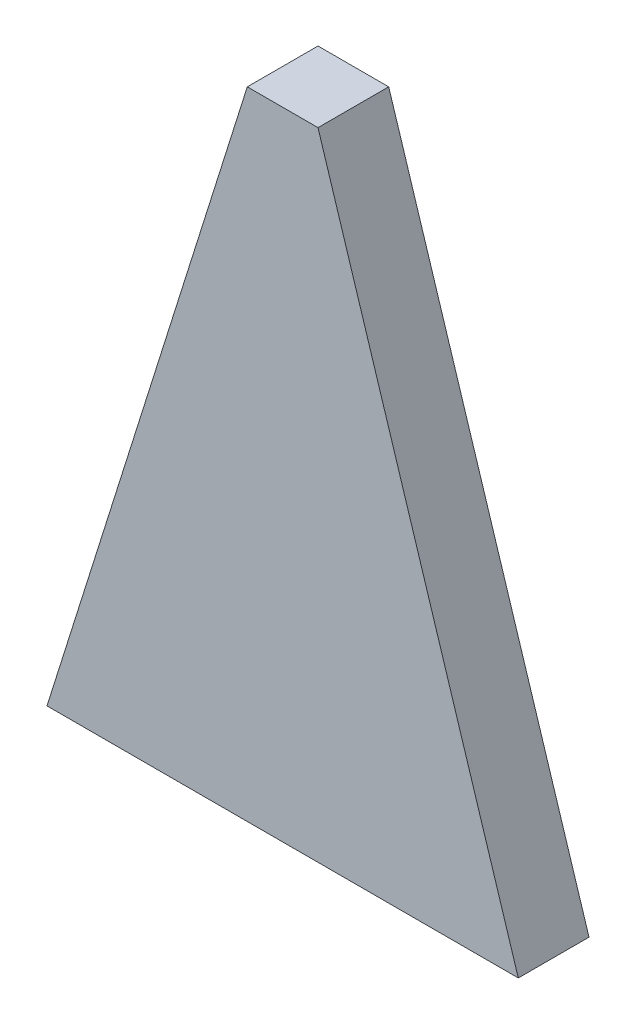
ISO-10303-21;
HEADER;
FILE_DESCRIPTION(('STEP AP214'),'2;1');
FILE_NAME('part.step','',(''),(''),'','','');
FILE_SCHEMA(('AUTOMOTIVE_DESIGN { 1 0 10303 214 1 1 1 1 }'));
ENDSEC;
DATA;
#1=APPLICATION_CONTEXT('core data for automotive mechanical design processes');
#2=APPLICATION_PROTOCOL_DEFINITION('international standard','automotive_design',2000,#1);
#3=PRODUCT_CONTEXT('',#1,'mechanical');
#4=PRODUCT('Part','Part','',(#3));
#5=PRODUCT_RELATED_PRODUCT_CATEGORY('part','',(#4));
#6=PRODUCT_DEFINITION_FORMATION('','',#4);
#7=PRODUCT_DEFINITION_CONTEXT('part definition',#1,'design');
#8=PRODUCT_DEFINITION('design','',#6,#7);
#9=PRODUCT_DEFINITION_SHAPE('','',#8);
#10=(LENGTH_UNIT() NAMED_UNIT(*) SI_UNIT(.MILLI.,.METRE.));
#11=(NAMED_UNIT(*) PLANE_ANGLE_UNIT() SI_UNIT($,.RADIAN.));
#12=(NAMED_UNIT(*) SI_UNIT($,.STERADIAN.) SOLID_ANGLE_UNIT());
#13=UNCERTAINTY_MEASURE_WITH_UNIT(LENGTH_MEASURE(1.E-05),#10,'distance_accuracy_value','');
#14=(GEOMETRIC_REPRESENTATION_CONTEXT(3) GLOBAL_UNCERTAINTY_ASSIGNED_CONTEXT((#13)) GLOBAL_UNIT_ASSIGNED_CONTEXT((#10,
#11,#12)) REPRESENTATION_CONTEXT('',''));
#15=CARTESIAN_POINT('',(0.,0.,0.));
#16=DIRECTION('',(0.,0.,1.));
#17=DIRECTION('',(1.,0.,0.));
#18=AXIS2_PLACEMENT_3D('',#15,#16,#17);
#19=CARTESIAN_POINT('',(-1.5,27.,3.));
#20=DIRECTION('',(0.953849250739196,-0.30028587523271,0.));
#21=DIRECTION('',(0.30028587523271,0.953849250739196,0.));
#22=AXIS2_PLACEMENT_3D('',#19,#20,#21);
#23=PLANE('',#22);
#24=DIRECTION('',(-0.30028587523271,-0.953849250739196,0.));
#25=VECTOR('',#24,1.);
#26=CARTESIAN_POINT('',(-1.5,27.,0.));
#27=LINE('',#26,#25);
#28=CARTESIAN_POINT('',(-1.5,27.,0.));
#29=VERTEX_POINT('',#28);
#30=CARTESIAN_POINT('',(-10.,0.,0.));
#31=VERTEX_POINT('',#30);
#32=EDGE_CURVE('E96',#29,#31,#27,.T.);
#33=ORIENTED_EDGE('',*,*,#32,.T.);
#34=DIRECTION('',(0.,0.,-1.));
#35=VECTOR('',#34,1.);
#36=CARTESIAN_POINT('',(-10.,0.,3.));
#37=LINE('',#36,#35);
#38=CARTESIAN_POINT('',(-10.,0.,3.));
#39=VERTEX_POINT('',#38);
#40=EDGE_CURVE('E11',#39,#31,#37,.T.);
#41=ORIENTED_EDGE('',*,*,#40,.F.);
#42=DIRECTION('',(-0.30028587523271,-0.953849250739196,0.));
#43=VECTOR('',#42,1.);
#44=CARTESIAN_POINT('',(-1.5,27.,3.));
#45=LINE('',#44,#43);
#46=CARTESIAN_POINT('',(-1.5,27.,3.));
#47=VERTEX_POINT('',#46);
#48=EDGE_CURVE('E84',#47,#39,#45,.T.);
#49=ORIENTED_EDGE('',*,*,#48,.F.);
#50=DIRECTION('',(0.,0.,-1.));
#51=VECTOR('',#50,1.);
#52=CARTESIAN_POINT('',(-1.5,27.,3.));
#53=LINE('',#52,#51);
#54=EDGE_CURVE('E92',#47,#29,#53,.T.);
#55=ORIENTED_EDGE('',*,*,#54,.T.);
#56=EDGE_LOOP('',(#33,#41,#49,#55));
#57=FACE_BOUND('',#56,.T.);
#58=ADVANCED_FACE('F33',(#57),#23,.F.);
#59=CARTESIAN_POINT('',(10.,0.,3.));
#60=DIRECTION('',(0.,1.,0.));
#61=DIRECTION('',(-1.,0.,0.));
#62=AXIS2_PLACEMENT_3D('',#59,#60,#61);
#63=PLANE('',#62);
#64=DIRECTION('',(1.,0.,0.));
#65=VECTOR('',#64,1.);
#66=CARTESIAN_POINT('',(10.,0.,0.));
#67=LINE('',#66,#65);
#68=CARTESIAN_POINT('',(10.,0.,0.));
#69=VERTEX_POINT('',#68);
#70=EDGE_CURVE('E88',#31,#69,#67,.T.);
#71=ORIENTED_EDGE('',*,*,#70,.T.);
#72=DIRECTION('',(0.,0.,-1.));
#73=VECTOR('',#72,1.);
#74=CARTESIAN_POINT('',(10.,0.,3.));
#75=LINE('',#74,#73);
#76=CARTESIAN_POINT('',(10.,0.,3.));
#77=VERTEX_POINT('',#76);
#78=EDGE_CURVE('E41',#77,#69,#75,.T.);
#79=ORIENTED_EDGE('',*,*,#78,.F.);
#80=DIRECTION('',(1.,0.,0.));
#81=VECTOR('',#80,1.);
#82=CARTESIAN_POINT('',(-10.,0.,3.));
#83=LINE('',#82,#81);
#84=EDGE_CURVE('E79',#39,#77,#83,.T.);
#85=ORIENTED_EDGE('',*,*,#84,.F.);
#86=ORIENTED_EDGE('',*,*,#40,.T.);
#87=EDGE_LOOP('',(#71,#79,#85,#86));
#88=FACE_BOUND('',#87,.T.);
#89=ADVANCED_FACE('F87',(#88),#63,.F.);
#90=CARTESIAN_POINT('',(1.5,27.,3.));
#91=DIRECTION('',(-0.953849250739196,-0.30028587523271,0.));
#92=DIRECTION('',(0.30028587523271,-0.953849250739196,0.));
#93=AXIS2_PLACEMENT_3D('',#90,#91,#92);
#94=PLANE('',#93);
#95=DIRECTION('',(-0.30028587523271,0.953849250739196,0.));
#96=VECTOR('',#95,1.);
#97=CARTESIAN_POINT('',(1.5,27.,0.));
#98=LINE('',#97,#96);
#99=CARTESIAN_POINT('',(1.5,27.,0.));
#100=VERTEX_POINT('',#99);
#101=EDGE_CURVE('E66',#69,#100,#98,.T.);
#102=ORIENTED_EDGE('',*,*,#101,.T.);
#103=DIRECTION('',(0.,0.,-1.));
#104=VECTOR('',#103,1.);
#105=CARTESIAN_POINT('',(1.5,27.,3.));
#106=LINE('',#105,#104);
#107=CARTESIAN_POINT('',(1.5,27.,3.));
#108=VERTEX_POINT('',#107);
#109=EDGE_CURVE('E89',#108,#100,#106,.T.);
#110=ORIENTED_EDGE('',*,*,#109,.F.);
#111=DIRECTION('',(-0.30028587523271,0.953849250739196,0.));
#112=VECTOR('',#111,1.);
#113=CARTESIAN_POINT('',(1.5,27.,3.));
#114=LINE('',#113,#112);
#115=EDGE_CURVE('E82',#77,#108,#114,.T.);
#116=ORIENTED_EDGE('',*,*,#115,.F.);
#117=ORIENTED_EDGE('',*,*,#78,.T.);
#118=EDGE_LOOP('',(#102,#110,#116,#117));
#119=FACE_BOUND('',#118,.T.);
#120=ADVANCED_FACE('F90',(#119),#94,.F.);
#121=CARTESIAN_POINT('',(1.5,27.,3.));
#122=DIRECTION('',(0.,-1.,0.));
#123=DIRECTION('',(0.,0.,-1.));
#124=AXIS2_PLACEMENT_3D('',#121,#122,#123);
#125=PLANE('',#124);
#126=DIRECTION('',(-1.,0.,0.));
#127=VECTOR('',#126,1.);
#128=CARTESIAN_POINT('',(1.5,27.,0.));
#129=LINE('',#128,#127);
#130=EDGE_CURVE('E72',#100,#29,#129,.T.);
#131=ORIENTED_EDGE('',*,*,#130,.T.);
#132=ORIENTED_EDGE('',*,*,#54,.F.);
#133=DIRECTION('',(-1.,0.,0.));
#134=VECTOR('',#133,1.);
#135=CARTESIAN_POINT('',(1.5,27.,3.));
#136=LINE('',#135,#134);
#137=EDGE_CURVE('E49',#108,#47,#136,.T.);
#138=ORIENTED_EDGE('',*,*,#137,.F.);
#139=ORIENTED_EDGE('',*,*,#109,.T.);
#140=EDGE_LOOP('',(#131,#132,#138,#139));
#141=FACE_BOUND('',#140,.T.);
#142=ADVANCED_FACE('F103',(#141),#125,.F.);
#143=CARTESIAN_POINT('',(0.,0.,3.));
#144=DIRECTION('',(0.,0.,1.));
#145=DIRECTION('',(1.,0.,0.));
#146=AXIS2_PLACEMENT_3D('',#143,#144,#145);
#147=PLANE('',#146);
#148=ORIENTED_EDGE('',*,*,#48,.T.);
#149=ORIENTED_EDGE('',*,*,#84,.T.);
#150=ORIENTED_EDGE('',*,*,#115,.T.);
#151=ORIENTED_EDGE('',*,*,#137,.T.);
#152=EDGE_LOOP('',(#148,#149,#150,#151));
#153=FACE_BOUND('',#152,.T.);
#154=ADVANCED_FACE('F80',(#153),#147,.T.);
#155=CARTESIAN_POINT('',(0.,0.,0.));
#156=DIRECTION('',(0.,0.,1.));
#157=DIRECTION('',(1.,0.,0.));
#158=AXIS2_PLACEMENT_3D('',#155,#156,#157);
#159=PLANE('',#158);
#160=ORIENTED_EDGE('',*,*,#32,.F.);
#161=ORIENTED_EDGE('',*,*,#130,.F.);
#162=ORIENTED_EDGE('',*,*,#101,.F.);
#163=ORIENTED_EDGE('',*,*,#70,.F.);
#164=EDGE_LOOP('',(#160,#161,#162,#163));
#165=FACE_BOUND('',#164,.T.);
#166=ADVANCED_FACE('F106',(#165),#159,.F.);
#167=CLOSED_SHELL('',(#58,#89,#120,#142,#154,#166));
#168=MANIFOLD_SOLID_BREP('B2',#167);
#169=ADVANCED_BREP_SHAPE_REPRESENTATION('',(#18,#168),#14);
#170=SHAPE_DEFINITION_REPRESENTATION(#9,#169);
ENDSEC;
END-ISO-10303-21;
